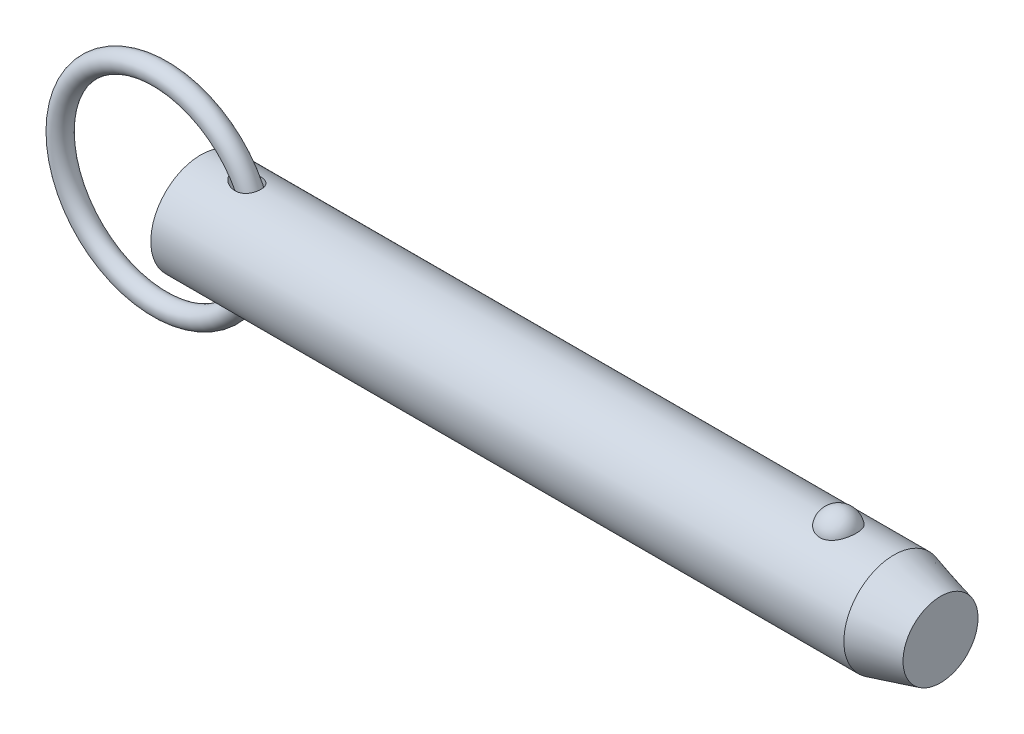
ISO-10303-21;
HEADER;
FILE_DESCRIPTION(('STEP AP214'),'2;1');
FILE_NAME('part.step','',(''),(''),'','','');
FILE_SCHEMA(('AUTOMOTIVE_DESIGN { 1 0 10303 214 1 1 1 1 }'));
ENDSEC;
DATA;
#1=APPLICATION_CONTEXT('core data for automotive mechanical design processes');
#2=APPLICATION_PROTOCOL_DEFINITION('international standard','automotive_design',2000,#1);
#3=PRODUCT_CONTEXT('',#1,'mechanical');
#4=PRODUCT('Part','Part','',(#3));
#5=PRODUCT_RELATED_PRODUCT_CATEGORY('part','',(#4));
#6=PRODUCT_DEFINITION_FORMATION('','',#4);
#7=PRODUCT_DEFINITION_CONTEXT('part definition',#1,'design');
#8=PRODUCT_DEFINITION('design','',#6,#7);
#9=PRODUCT_DEFINITION_SHAPE('','',#8);
#10=(LENGTH_UNIT() NAMED_UNIT(*) SI_UNIT(.MILLI.,.METRE.));
#11=(NAMED_UNIT(*) PLANE_ANGLE_UNIT() SI_UNIT($,.RADIAN.));
#12=(NAMED_UNIT(*) SI_UNIT($,.STERADIAN.) SOLID_ANGLE_UNIT());
#13=UNCERTAINTY_MEASURE_WITH_UNIT(LENGTH_MEASURE(1.E-05),#10,'distance_accuracy_value','');
#14=(GEOMETRIC_REPRESENTATION_CONTEXT(3) GLOBAL_UNCERTAINTY_ASSIGNED_CONTEXT((#13)) GLOBAL_UNIT_ASSIGNED_CONTEXT((#10,
#11,#12)) REPRESENTATION_CONTEXT('',''));
#15=CARTESIAN_POINT('',(0.,0.,0.));
#16=DIRECTION('',(0.,0.,1.));
#17=DIRECTION('',(1.,0.,0.));
#18=AXIS2_PLACEMENT_3D('',#15,#16,#17);
#19=CARTESIAN_POINT('',(-6.46799987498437,0.,0.));
#20=DIRECTION('',(0.,0.,1.));
#21=DIRECTION('',(1.,0.,0.));
#22=AXIS2_PLACEMENT_3D('',#19,#20,#21);
#23=TOROIDAL_SURFACE('',#22,15.875,1.588);
#24=CARTESIAN_POINT('',(10.9950001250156,0.,0.));
#25=VERTEX_POINT('',#24);
#26=VERTEX_LOOP('',#25);
#27=FACE_BOUND('',#26,.T.);
#28=ADVANCED_FACE('P0_F12',(#27),#23,.T.);
#29=CLOSED_SHELL('',(#28));
#30=MANIFOLD_SOLID_BREP('P0_B1',#29);
#31=CARTESIAN_POINT('',(0.,0.,0.));
#32=DIRECTION('',(1.,0.,0.));
#33=DIRECTION('',(0.,0.,-1.));
#34=AXIS2_PLACEMENT_3D('',#31,#32,#33);
#35=CYLINDRICAL_SURFACE('',#34,7.94);
#36=CARTESIAN_POINT('',(5.37881269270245,7.8641200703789,-1.0950869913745));
#37=CARTESIAN_POINT('',(5.49078530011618,7.84653010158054,-1.22142628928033));
#38=CARTESIAN_POINT('',(5.61742164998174,7.82766483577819,-1.33478448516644));
#39=CARTESIAN_POINT('',(5.82155225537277,7.80005811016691,-1.48501770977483));
#40=CARTESIAN_POINT('',(5.89211597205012,7.79095331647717,-1.53186949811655));
#41=CARTESIAN_POINT('',(6.03726296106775,7.77331484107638,-1.61899652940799));
#42=CARTESIAN_POINT('',(6.11184478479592,7.76478095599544,-1.65927412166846));
#43=CARTESIAN_POINT('',(6.31831542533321,7.74290334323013,-1.75933205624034));
#44=CARTESIAN_POINT('',(6.45343253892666,7.73042593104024,-1.81276183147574));
#45=CARTESIAN_POINT('',(6.73017339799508,7.70966096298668,-1.89912673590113));
#46=CARTESIAN_POINT('',(6.8717909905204,7.70136953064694,-1.93208083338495));
#47=CARTESIAN_POINT('',(7.17522096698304,7.6896684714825,-1.97820987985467));
#48=CARTESIAN_POINT('',(7.33750100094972,7.68691980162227,-1.98871513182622));
#49=CARTESIAN_POINT('',(7.5799424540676,7.68880305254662,-1.98137951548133));
#50=CARTESIAN_POINT('',(7.66059155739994,7.69043175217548,-1.97508575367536));
#51=CARTESIAN_POINT('',(7.82077465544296,7.69570110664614,-1.95445819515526));
#52=CARTESIAN_POINT('',(7.9003091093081,7.69934090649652,-1.94012781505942));
#53=CARTESIAN_POINT('',(8.09280087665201,7.71066069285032,-1.89475688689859));
#54=CARTESIAN_POINT('',(8.20465204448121,7.71942251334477,-1.85909462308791));
#55=CARTESIAN_POINT('',(8.42059371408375,7.74035594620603,-1.7699066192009));
#56=CARTESIAN_POINT('',(8.52468939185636,7.75252525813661,-1.7163929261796));
#57=CARTESIAN_POINT('',(8.72211003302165,7.77903750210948,-1.59192358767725));
#58=CARTESIAN_POINT('',(8.81539818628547,7.79338749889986,-1.52091076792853));
#59=CARTESIAN_POINT('',(8.98759177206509,7.8225086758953,-1.36321590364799));
#60=CARTESIAN_POINT('',(9.06649712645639,7.83727985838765,-1.27653377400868));
#61=CARTESIAN_POINT('',(9.20311499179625,7.86453692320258,-1.09567667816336));
#62=CARTESIAN_POINT('',(9.26180839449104,7.8771064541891,-1.00225329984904));
#63=CARTESIAN_POINT('',(9.36257622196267,7.89954213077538,-0.806547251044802));
#64=CARTESIAN_POINT('',(9.40465301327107,7.9094086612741,-0.704265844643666));
#65=CARTESIAN_POINT('',(9.47062404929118,7.92520709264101,-0.49546189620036));
#66=CARTESIAN_POINT('',(9.4947881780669,7.9311972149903,-0.389028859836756));
#67=CARTESIAN_POINT('',(9.52544004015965,7.93883641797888,-0.173494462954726));
#68=CARTESIAN_POINT('',(9.53192786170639,7.94048552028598,-0.0643931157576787));
#69=CARTESIAN_POINT('',(9.52707996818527,7.93926454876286,0.153487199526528));
#70=CARTESIAN_POINT('',(9.51572796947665,7.93639034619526,0.26226578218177));
#71=CARTESIAN_POINT('',(9.47542322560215,7.92642470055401,0.476313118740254));
#72=CARTESIAN_POINT('',(9.44647056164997,7.91933327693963,0.58158188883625));
#73=CARTESIAN_POINT('',(9.37164011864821,7.90170355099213,0.785602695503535));
#74=CARTESIAN_POINT('',(9.32576415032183,7.89116561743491,0.884355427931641));
#75=CARTESIAN_POINT('',(9.21823065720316,7.8677977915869,1.07254831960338));
#76=CARTESIAN_POINT('',(9.15657431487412,7.85496807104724,1.16198917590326));
#77=CARTESIAN_POINT('',(9.01919194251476,7.82843688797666,1.32903649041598));
#78=CARTESIAN_POINT('',(8.94347744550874,7.81473614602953,1.40665255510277));
#79=CARTESIAN_POINT('',(8.78012086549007,7.7879321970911,1.5481977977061));
#80=CARTESIAN_POINT('',(8.69247914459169,7.77482897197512,1.61212739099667));
#81=CARTESIAN_POINT('',(8.50642314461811,7.75037063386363,1.72592270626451));
#82=CARTESIAN_POINT('',(8.40786430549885,7.73904540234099,1.77555777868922));
#83=CARTESIAN_POINT('',(8.2039870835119,7.71943979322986,1.85894844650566));
#84=CARTESIAN_POINT('',(8.0986670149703,7.7111601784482,1.89270006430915));
#85=CARTESIAN_POINT('',(7.87703213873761,7.69782475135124,1.94625652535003));
#86=CARTESIAN_POINT('',(7.76044899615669,7.69301557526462,1.96500324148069));
#87=CARTESIAN_POINT('',(7.52574256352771,7.68770484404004,1.98567257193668));
#88=CARTESIAN_POINT('',(7.40761868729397,7.68720497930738,1.98758858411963));
#89=CARTESIAN_POINT('',(7.15639592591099,7.69044495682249,1.97502233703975));
#90=CARTESIAN_POINT('',(7.02341871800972,7.69476380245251,1.9583009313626));
#91=CARTESIAN_POINT('',(6.76125891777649,7.70776394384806,1.90648094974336));
#92=CARTESIAN_POINT('',(6.6320804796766,7.71644984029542,1.87136299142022));
#93=CARTESIAN_POINT('',(6.35978215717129,7.73875442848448,1.77707737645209));
#94=CARTESIAN_POINT('',(6.2177212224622,7.75293863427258,1.71496895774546));
#95=CARTESIAN_POINT('',(5.94559201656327,7.78383102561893,1.56880760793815));
#96=CARTESIAN_POINT('',(5.81552062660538,7.80053855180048,1.48476040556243));
#97=CARTESIAN_POINT('',(5.60081087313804,7.83035955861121,1.31701356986));
#98=CARTESIAN_POINT('',(5.51265224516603,7.84340226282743,1.23780647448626));
#99=CARTESIAN_POINT('',(5.34976240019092,7.86852524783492,1.06647953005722));
#100=CARTESIAN_POINT('',(5.27500719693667,7.88060722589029,0.974383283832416));
#101=CARTESIAN_POINT('',(5.15877594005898,7.89990441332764,0.800548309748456));
#102=CARTESIAN_POINT('',(5.11360209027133,7.90759876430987,0.721348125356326));
#103=CARTESIAN_POINT('',(5.03655060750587,7.92090267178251,0.55651819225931));
#104=CARTESIAN_POINT('',(5.00466157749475,7.92651401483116,0.470894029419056));
#105=CARTESIAN_POINT('',(4.95653766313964,7.93503671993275,0.294356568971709));
#106=CARTESIAN_POINT('',(4.94043621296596,7.93792505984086,0.203404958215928));
#107=CARTESIAN_POINT('',(4.92605720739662,7.94050250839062,0.0200631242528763));
#108=CARTESIAN_POINT('',(4.92776929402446,7.9401934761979,-0.0723262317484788));
#109=CARTESIAN_POINT('',(4.94742735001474,7.93667454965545,-0.243250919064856));
#110=CARTESIAN_POINT('',(4.96327131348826,7.93384031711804,-0.322048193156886));
#111=CARTESIAN_POINT('',(5.00707570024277,7.92609115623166,-0.476058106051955));
#112=CARTESIAN_POINT('',(5.03503965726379,7.92117562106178,-0.55126969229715));
#113=CARTESIAN_POINT('',(5.10737112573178,7.90866290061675,-0.709995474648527));
#114=CARTESIAN_POINT('',(5.15379379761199,7.90074105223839,-0.792541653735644));
#115=CARTESIAN_POINT('',(5.2582083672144,7.88338732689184,-0.949781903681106));
#116=CARTESIAN_POINT('',(5.31621941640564,7.87395295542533,-1.02446265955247));
#117=CARTESIAN_POINT('',(5.37881269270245,7.8641200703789,-1.0950869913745));
#118=B_SPLINE_CURVE_WITH_KNOTS('',3,(#36,#37,#38,#39,#40,#41,#42,#43,#44,#45,#46,#47,#48,#49,
#50,#51,#52,#53,#54,#55,#56,#57,#58,#59,#60,#61,#62,#63,#64,#65,#66,#67,#68,#69,#70,#71,#72,#73,
#74,#75,#76,#77,#78,#79,#80,#81,#82,#83,#84,#85,#86,#87,#88,#89,#90,#91,#92,#93,#94,#95,#96,#97,
#98,#99,#100,#101,#102,#103,#104,#105,#106,#107,#108,#109,#110,#111,#112,#113,#114,#115,#116,
#117),.UNSPECIFIED.,.T.,.F.,(4,2,2,2,2,2,2,2,2,2,2,2,2,2,2,2,2,2,2,2,2,2,2,2,2,2,2,2,2,2,2,2,2,
2,2,2,2,2,2,2,4),(0.,0.508599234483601,0.763935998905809,1.01918131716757,1.45492798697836,
1.89027038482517,2.37502798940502,2.61739702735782,2.85966310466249,3.21120678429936,
3.56251370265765,3.91498401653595,4.26745624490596,4.59897839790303,4.93045331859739,
5.2568264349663,5.58319792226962,5.909867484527,6.23653553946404,6.56316865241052,
6.88977729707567,7.21611917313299,7.54245114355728,7.87378632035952,8.20520442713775,
8.55832700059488,8.91158808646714,9.31234018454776,9.71351536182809,10.1786231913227,
10.6436096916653,11.0001264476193,11.3559986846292,11.6294791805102,11.9027245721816,
12.1782599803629,12.4536351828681,12.693828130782,12.9340911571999,13.2179277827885,
13.5022374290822),.UNSPECIFIED.);
#119=CARTESIAN_POINT('',(5.37881269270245,7.8641200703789,-1.0950869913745));
#120=VERTEX_POINT('',#119);
#121=EDGE_CURVE('P1_E40',#120,#120,#118,.T.);
#122=ORIENTED_EDGE('',*,*,#121,.T.);
#123=EDGE_LOOP('',(#122));
#124=FACE_BOUND('',#123,.T.);
#125=CARTESIAN_POINT('',(110.071879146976,0.,0.));
#126=DIRECTION('',(1.,0.,0.));
#127=DIRECTION('',(0.,0.,-1.));
#128=AXIS2_PLACEMENT_3D('',#125,#126,#127);
#129=CIRCLE('',#128,7.94);
#130=CARTESIAN_POINT('',(110.071879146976,0.,-7.94));
#131=VERTEX_POINT('',#130);
#132=EDGE_CURVE('P1_E25',#131,#131,#129,.T.);
#133=ORIENTED_EDGE('',*,*,#132,.F.);
#134=EDGE_LOOP('',(#133));
#135=FACE_BOUND('',#134,.T.);
#136=CARTESIAN_POINT('',(0.,0.,0.));
#137=DIRECTION('',(1.,0.,0.));
#138=DIRECTION('',(0.,0.,-1.));
#139=AXIS2_PLACEMENT_3D('',#136,#137,#138);
#140=CIRCLE('',#139,7.94);
#141=CARTESIAN_POINT('',(0.,0.,-7.94));
#142=VERTEX_POINT('',#141);
#143=EDGE_CURVE('P1_E9',#142,#142,#140,.T.);
#144=ORIENTED_EDGE('',*,*,#143,.T.);
#145=EDGE_LOOP('',(#144));
#146=FACE_BOUND('',#145,.T.);
#147=CARTESIAN_POINT('',(101.264907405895,7.37767842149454,2.93486986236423));
#148=CARTESIAN_POINT('',(101.112749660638,7.3776732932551,2.93487505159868));
#149=CARTESIAN_POINT('',(100.960632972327,7.38258419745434,2.92262454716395));
#150=CARTESIAN_POINT('',(100.660928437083,7.40163229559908,2.87404196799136));
#151=CARTESIAN_POINT('',(100.513339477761,7.41576720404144,2.83771585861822));
#152=CARTESIAN_POINT('',(100.227018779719,7.4516157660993,2.74218769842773));
#153=CARTESIAN_POINT('',(100.088274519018,7.47331841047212,2.68301886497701));
#154=CARTESIAN_POINT('',(99.8228822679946,7.52194082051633,2.54350967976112));
#155=CARTESIAN_POINT('',(99.6962366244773,7.5488615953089,2.46316523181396));
#156=CARTESIAN_POINT('',(99.4545349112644,7.60594671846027,2.28090375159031));
#157=CARTESIAN_POINT('',(99.3399065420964,7.63618114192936,2.17844211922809));
#158=CARTESIAN_POINT('',(99.1288787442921,7.69614046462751,1.95608495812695));
#159=CARTESIAN_POINT('',(99.0324826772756,7.72586526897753,1.83618622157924));
#160=CARTESIAN_POINT('',(98.8559381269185,7.78314821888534,1.57628086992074));
#161=CARTESIAN_POINT('',(98.7767072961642,7.81055035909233,1.43561546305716));
#162=CARTESIAN_POINT('',(98.6417979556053,7.85879631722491,1.14236334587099));
#163=CARTESIAN_POINT('',(98.5861216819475,7.87963951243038,0.989775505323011));
#164=CARTESIAN_POINT('',(98.4988121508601,7.91289645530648,0.674619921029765));
#165=CARTESIAN_POINT('',(98.4675309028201,7.925186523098,0.511941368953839));
#166=CARTESIAN_POINT('',(98.430975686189,7.93958930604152,0.183247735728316));
#167=CARTESIAN_POINT('',(98.4257012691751,7.94170219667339,0.0172327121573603));
#168=CARTESIAN_POINT('',(98.4412311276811,7.93554931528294,-0.312672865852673));
#169=CARTESIAN_POINT('',(98.4619253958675,7.92732732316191,-0.476569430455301));
#170=CARTESIAN_POINT('',(98.5287865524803,7.90141534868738,-0.798305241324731));
#171=CARTESIAN_POINT('',(98.5749539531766,7.88372517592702,-0.956144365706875));
#172=CARTESIAN_POINT('',(98.6918986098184,7.84066230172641,-1.26152073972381));
#173=CARTESIAN_POINT('',(98.7627046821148,7.81528060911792,-1.40904568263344));
#174=CARTESIAN_POINT('',(98.9274789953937,7.7594867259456,-1.68950598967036));
#175=CARTESIAN_POINT('',(99.0214488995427,7.72907417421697,-1.82244030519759));
#176=CARTESIAN_POINT('',(99.2308391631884,7.66640424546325,-2.07032792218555));
#177=CARTESIAN_POINT('',(99.3463152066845,7.63414223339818,-2.1852330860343));
#178=CARTESIAN_POINT('',(99.5959006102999,7.57149681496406,-2.39329737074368));
#179=CARTESIAN_POINT('',(99.7300080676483,7.54111321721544,-2.48645870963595));
#180=CARTESIAN_POINT('',(100.010111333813,7.48650742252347,-2.64628132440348));
#181=CARTESIAN_POINT('',(100.155760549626,7.46215900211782,-2.71350554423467));
#182=CARTESIAN_POINT('',(100.457425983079,7.42171253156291,-2.82226614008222));
#183=CARTESIAN_POINT('',(100.613438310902,7.40561140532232,-2.86381209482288));
#184=CARTESIAN_POINT('',(100.922970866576,7.3842679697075,-2.9183907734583));
#185=CARTESIAN_POINT('',(101.076222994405,7.37852109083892,-2.93275024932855));
#186=CARTESIAN_POINT('',(101.383070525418,7.37700973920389,-2.93655208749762));
#187=CARTESIAN_POINT('',(101.536665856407,7.38124333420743,-2.92599927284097));
#188=CARTESIAN_POINT('',(101.834990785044,7.39890635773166,-2.88102897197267));
#189=CARTESIAN_POINT('',(101.979848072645,7.41205491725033,-2.8473399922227));
#190=CARTESIAN_POINT('',(102.26164329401,7.445801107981,-2.75788206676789));
#191=CARTESIAN_POINT('',(102.398580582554,7.46639934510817,-2.70211132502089));
#192=CARTESIAN_POINT('',(102.664061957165,7.51339098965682,-2.56858908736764));
#193=CARTESIAN_POINT('',(102.792354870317,7.53990200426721,-2.49038067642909));
#194=CARTESIAN_POINT('',(103.034244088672,7.59569503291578,-2.31462737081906));
#195=CARTESIAN_POINT('',(103.147837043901,7.62497767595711,-2.21707808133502));
#196=CARTESIAN_POINT('',(103.36322156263,7.68489473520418,-1.99982049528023));
#197=CARTESIAN_POINT('',(103.464148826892,7.71552419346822,-1.87925337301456));
#198=CARTESIAN_POINT('',(103.645186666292,7.77353016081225,-1.62268826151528));
#199=CARTESIAN_POINT('',(103.725293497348,7.80090608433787,-1.4866875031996));
#200=CARTESIAN_POINT('',(103.865361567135,7.85047992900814,-1.19818413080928));
#201=CARTESIAN_POINT('',(103.924587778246,7.8724818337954,-1.04529016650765));
#202=CARTESIAN_POINT('',(104.017982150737,7.90785114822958,-0.731080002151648));
#203=CARTESIAN_POINT('',(104.052149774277,7.92121837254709,-0.569763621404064));
#204=CARTESIAN_POINT('',(104.094795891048,7.93797834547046,-0.242812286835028));
#205=CARTESIAN_POINT('',(104.103204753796,7.94134405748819,-0.0771668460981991));
#206=CARTESIAN_POINT('',(104.093962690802,7.93767937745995,0.253276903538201));
#207=CARTESIAN_POINT('',(104.076312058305,7.93064910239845,0.41807522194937));
#208=CARTESIAN_POINT('',(104.015424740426,7.90695571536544,0.741525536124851));
#209=CARTESIAN_POINT('',(103.972281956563,7.8903279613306,0.900197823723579));
#210=CARTESIAN_POINT('',(103.86135358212,7.84916386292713,1.20759654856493));
#211=CARTESIAN_POINT('',(103.79356656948,7.82462706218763,1.35632241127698));
#212=CARTESIAN_POINT('',(103.634371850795,7.7700669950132,1.64032869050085));
#213=CARTESIAN_POINT('',(103.542861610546,7.7400200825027,1.77554712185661));
#214=CARTESIAN_POINT('',(103.338296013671,7.67774175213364,2.02800648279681));
#215=CARTESIAN_POINT('',(103.225241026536,7.64551037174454,2.14524772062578));
#216=CARTESIAN_POINT('',(102.980831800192,7.58265895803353,2.35778002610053));
#217=CARTESIAN_POINT('',(102.849583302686,7.5520309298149,2.45319004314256));
#218=CARTESIAN_POINT('',(102.571601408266,7.49579792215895,2.61999897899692));
#219=CARTESIAN_POINT('',(102.424867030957,7.47019326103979,2.69139637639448));
#220=CARTESIAN_POINT('',(102.112947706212,7.42622216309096,2.8105324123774));
#221=CARTESIAN_POINT('',(101.947220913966,7.40825002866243,2.85700910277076));
#222=CARTESIAN_POINT('',(101.609279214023,7.38398348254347,2.9191685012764));
#223=CARTESIAN_POINT('',(101.43706702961,7.3776842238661,2.93486399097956));
#224=CARTESIAN_POINT('',(101.264907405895,7.37767842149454,2.93486986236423));
#225=B_SPLINE_CURVE_WITH_KNOTS('',3,(#147,#148,#149,#150,#151,#152,#153,#154,#155,#156,#157,
#158,#159,#160,#161,#162,#163,#164,#165,#166,#167,#168,#169,#170,#171,#172,#173,#174,#175,#176,
#177,#178,#179,#180,#181,#182,#183,#184,#185,#186,#187,#188,#189,#190,#191,#192,#193,#194,#195,
#196,#197,#198,#199,#200,#201,#202,#203,#204,#205,#206,#207,#208,#209,#210,#211,#212,#213,#214,
#215,#216,#217,#218,#219,#220,#221,#222,#223,#224),.UNSPECIFIED.,.T.,.F.,(4,2,2,2,2,2,2,2,2,2,2,
2,2,2,2,2,2,2,2,2,2,2,2,2,2,2,2,2,2,2,2,2,2,2,2,2,2,2,4),(0.,0.45584132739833,0.911569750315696,
1.36663794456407,1.8217942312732,2.28978983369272,2.7578716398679,3.246853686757,
3.73588214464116,4.23184282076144,4.7277949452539,5.22165321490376,5.71552141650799,
6.20996917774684,6.70445245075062,7.20023431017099,7.69596557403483,8.18023418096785,
8.66432203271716,9.12410697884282,9.58380291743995,10.0296503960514,10.4755341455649,
10.9312349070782,11.3870393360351,11.8654416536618,12.3439299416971,12.8378875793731,
13.3318558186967,13.8271581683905,14.3224549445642,14.8159385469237,15.3094506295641,
15.8051323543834,16.3008055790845,16.7937101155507,17.2866458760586,17.8026240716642,
18.3183879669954),.UNSPECIFIED.);
#226=CARTESIAN_POINT('',(101.264907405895,7.37767842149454,2.93486986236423));
#227=VERTEX_POINT('',#226);
#228=EDGE_CURVE('P1_E34',#227,#227,#225,.T.);
#229=ORIENTED_EDGE('',*,*,#228,.T.);
#230=EDGE_LOOP('',(#229));
#231=FACE_BOUND('',#230,.T.);
#232=CARTESIAN_POINT('',(5.37881269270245,-7.8641200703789,-1.0950869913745));
#233=CARTESIAN_POINT('',(5.31532711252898,-7.87409326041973,-1.02345575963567));
#234=CARTESIAN_POINT('',(5.25654962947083,-7.88365715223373,-0.947641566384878));
#235=CARTESIAN_POINT('',(5.15093536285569,-7.90122221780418,-0.787865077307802));
#236=CARTESIAN_POINT('',(5.10408931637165,-7.90922460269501,-0.703909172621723));
#237=CARTESIAN_POINT('',(5.02499142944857,-7.92292057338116,-0.527991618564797));
#238=CARTESIAN_POINT('',(4.99290048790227,-7.92858863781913,-0.435954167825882));
#239=CARTESIAN_POINT('',(4.94718343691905,-7.93670712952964,-0.247266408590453));
#240=CARTESIAN_POINT('',(4.93353142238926,-7.93916207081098,-0.150622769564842));
#241=CARTESIAN_POINT('',(4.92669426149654,-7.94038957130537,0.03064599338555));
#242=CARTESIAN_POINT('',(4.9310562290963,-7.93960347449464,0.115182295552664));
#243=CARTESIAN_POINT('',(4.95441758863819,-7.93542535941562,0.282133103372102));
#244=CARTESIAN_POINT('',(4.97342060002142,-7.93203269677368,0.364547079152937));
#245=CARTESIAN_POINT('',(5.02337664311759,-7.92322764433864,0.521528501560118));
#246=CARTESIAN_POINT('',(5.05377582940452,-7.91790920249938,0.596281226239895));
#247=CARTESIAN_POINT('',(5.1246872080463,-7.90571364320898,0.740640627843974));
#248=CARTESIAN_POINT('',(5.16520358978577,-7.89883588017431,0.810245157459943));
#249=CARTESIAN_POINT('',(5.27792634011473,-7.88012470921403,0.978620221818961));
#250=CARTESIAN_POINT('',(5.35563200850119,-7.86757912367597,1.07363778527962));
#251=CARTESIAN_POINT('',(5.52523836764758,-7.84150676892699,1.24994147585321));
#252=CARTESIAN_POINT('',(5.61717506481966,-7.82797755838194,1.33119164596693));
#253=CARTESIAN_POINT('',(5.83913717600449,-7.79742756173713,1.50104748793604));
#254=CARTESIAN_POINT('',(5.9725742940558,-7.78050347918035,1.58521567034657));
#255=CARTESIAN_POINT('',(6.25160600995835,-7.74942135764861,1.73078109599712));
#256=CARTESIAN_POINT('',(6.39720857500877,-7.73526515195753,1.79216327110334));
#257=CARTESIAN_POINT('',(6.69793322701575,-7.7116170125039,1.89134478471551));
#258=CARTESIAN_POINT('',(6.85312134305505,-7.70216275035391,1.92895428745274));
#259=CARTESIAN_POINT('',(7.16781951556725,-7.68988337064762,1.97736316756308));
#260=CARTESIAN_POINT('',(7.32732244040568,-7.68704791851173,1.98820434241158));
#261=CARTESIAN_POINT('',(7.61290770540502,-7.68890797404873,1.98097687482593));
#262=CARTESIAN_POINT('',(7.73913797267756,-7.69217875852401,1.96837928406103));
#263=CARTESIAN_POINT('',(7.98774248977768,-7.70364253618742,1.92303262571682));
#264=CARTESIAN_POINT('',(8.11011880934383,-7.71183283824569,1.89029457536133));
#265=CARTESIAN_POINT('',(8.34766306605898,-7.73253074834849,1.80375920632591));
#266=CARTESIAN_POINT('',(8.46278682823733,-7.74506226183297,1.74984505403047));
#267=CARTESIAN_POINT('',(8.6806268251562,-7.77294147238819,1.62149891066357));
#268=CARTESIAN_POINT('',(8.78334736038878,-7.78828818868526,1.54707406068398));
#269=CARTESIAN_POINT('',(8.96275951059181,-7.81808719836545,1.38814746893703));
#270=CARTESIAN_POINT('',(9.0410292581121,-7.83247448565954,1.30540890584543));
#271=CARTESIAN_POINT('',(9.18176824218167,-7.86008608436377,1.1272733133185));
#272=CARTESIAN_POINT('',(9.24424163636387,-7.87331070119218,1.03187962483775));
#273=CARTESIAN_POINT('',(9.34924815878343,-7.89649032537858,0.835684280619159));
#274=CARTESIAN_POINT('',(9.39252490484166,-7.90656172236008,0.73529314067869));
#275=CARTESIAN_POINT('',(9.46188913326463,-7.92307290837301,0.528458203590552));
#276=CARTESIAN_POINT('',(9.48797767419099,-7.92951292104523,0.422014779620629));
#277=CARTESIAN_POINT('',(9.5222867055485,-7.93804067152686,0.206589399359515));
#278=CARTESIAN_POINT('',(9.53058328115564,-7.94014694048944,0.0976202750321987));
#279=CARTESIAN_POINT('',(9.52935292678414,-7.93983698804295,-0.120212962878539));
#280=CARTESIAN_POINT('',(9.51982577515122,-7.9374207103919,-0.229077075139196));
#281=CARTESIAN_POINT('',(9.48313466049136,-7.92831916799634,-0.443751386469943));
#282=CARTESIAN_POINT('',(9.45594838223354,-7.92162850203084,-0.549557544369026));
#283=CARTESIAN_POINT('',(9.3845465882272,-7.90469917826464,-0.754954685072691));
#284=CARTESIAN_POINT('',(9.34033171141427,-7.89446065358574,-0.854545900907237));
#285=CARTESIAN_POINT('',(9.23602927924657,-7.87157146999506,-1.04456732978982));
#286=CARTESIAN_POINT('',(9.17596171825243,-7.85892385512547,-1.13500888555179));
#287=CARTESIAN_POINT('',(9.04153430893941,-7.83259746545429,-1.30436780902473));
#288=CARTESIAN_POINT('',(8.96717562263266,-7.81891877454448,-1.38328611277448));
#289=CARTESIAN_POINT('',(8.80603455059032,-7.79196869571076,-1.52782923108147));
#290=CARTESIAN_POINT('',(8.71921490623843,-7.77869867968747,-1.59341269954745));
#291=CARTESIAN_POINT('',(8.53589430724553,-7.7539823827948,-1.7096493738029));
#292=CARTESIAN_POINT('',(8.43939269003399,-7.74253622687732,-1.76030155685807));
#293=CARTESIAN_POINT('',(8.23614706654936,-7.72219212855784,-1.84754820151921));
#294=CARTESIAN_POINT('',(8.12916866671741,-7.71339202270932,-1.88361685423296));
#295=CARTESIAN_POINT('',(7.91082287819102,-7.69955300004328,-1.93940887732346));
#296=CARTESIAN_POINT('',(7.79945379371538,-7.69451555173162,-1.95912586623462));
#297=CARTESIAN_POINT('',(7.56409927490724,-7.6881073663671,-1.98413612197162));
#298=CARTESIAN_POINT('',(7.43993744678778,-7.68713944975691,-1.98784574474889));
#299=CARTESIAN_POINT('',(7.19239878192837,-7.68969629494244,-1.97792309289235));
#300=CARTESIAN_POINT('',(7.0690222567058,-7.69322274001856,-1.96428432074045));
#301=CARTESIAN_POINT('',(6.80624991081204,-7.70498367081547,-1.91768089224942));
#302=CARTESIAN_POINT('',(6.667361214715,-7.71386737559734,-1.88203087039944));
#303=CARTESIAN_POINT('',(6.39625444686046,-7.73551250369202,-1.79098714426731));
#304=CARTESIAN_POINT('',(6.26404857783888,-7.74828074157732,-1.73555871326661));
#305=CARTESIAN_POINT('',(6.06559048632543,-7.77003865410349,-1.63446133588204));
#306=CARTESIAN_POINT('',(5.99591479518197,-7.77821880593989,-1.59522999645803));
#307=CARTESIAN_POINT('',(5.86025875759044,-7.79503524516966,-1.51091846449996));
#308=CARTESIAN_POINT('',(5.79427944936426,-7.80367165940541,-1.46583664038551));
#309=CARTESIAN_POINT('',(5.60322733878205,-7.82978128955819,-1.3219827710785));
#310=CARTESIAN_POINT('',(5.48449649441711,-7.84751780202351,-1.21433077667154));
#311=CARTESIAN_POINT('',(5.37881269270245,-7.8641200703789,-1.0950869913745));
#312=B_SPLINE_CURVE_WITH_KNOTS('',3,(#232,#233,#234,#235,#236,#237,#238,#239,#240,#241,#242,
#243,#244,#245,#246,#247,#248,#249,#250,#251,#252,#253,#254,#255,#256,#257,#258,#259,#260,#261,
#262,#263,#264,#265,#266,#267,#268,#269,#270,#271,#272,#273,#274,#275,#276,#277,#278,#279,#280,
#281,#282,#283,#284,#285,#286,#287,#288,#289,#290,#291,#292,#293,#294,#295,#296,#297,#298,#299,
#300,#301,#302,#303,#304,#305,#306,#307,#308,#309,#310,#311),.UNSPECIFIED.,.T.,.F.,(4,2,2,2,2,2,
2,2,2,2,2,2,2,2,2,2,2,2,2,2,2,2,2,2,2,2,2,2,2,2,2,2,2,2,2,2,2,2,2,4),(0.,0.288363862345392,
0.576503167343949,0.867714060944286,1.15851540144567,1.41111828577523,1.66378363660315,
1.90549406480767,2.1473047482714,2.51540453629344,2.88445136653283,3.35805159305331,
3.83196445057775,4.30961543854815,4.78652012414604,5.16565662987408,5.54458592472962,
5.92563591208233,6.30655339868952,6.64920782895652,6.99177197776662,7.31956587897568,
7.64733959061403,7.97370879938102,8.30008206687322,8.62686856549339,8.95364280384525,
9.28000684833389,9.60634436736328,9.93367879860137,10.261035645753,10.59932199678,
10.9377403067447,11.308967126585,11.6803330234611,12.1096921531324,12.5398088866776,
12.7806650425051,13.0215885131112,13.5016249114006),.UNSPECIFIED.);
#313=CARTESIAN_POINT('',(5.37881269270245,-7.8641200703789,-1.0950869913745));
#314=VERTEX_POINT('',#313);
#315=EDGE_CURVE('P1_E17',#314,#314,#312,.T.);
#316=ORIENTED_EDGE('',*,*,#315,.T.);
#317=EDGE_LOOP('',(#316));
#318=FACE_BOUND('',#317,.T.);
#319=ADVANCED_FACE('P1_F13',(#124,#135,#146,#231,#318),#35,.T.);
#320=CARTESIAN_POINT('',(0.,0.,0.));
#321=DIRECTION('',(-1.,0.,0.));
#322=DIRECTION('',(0.,0.,1.));
#323=AXIS2_PLACEMENT_3D('',#320,#321,#322);
#324=PLANE('',#323);
#325=ORIENTED_EDGE('',*,*,#143,.F.);
#326=EDGE_LOOP('',(#325));
#327=FACE_BOUND('',#326,.T.);
#328=ADVANCED_FACE('P1_F15',(#327),#324,.T.);
#329=CARTESIAN_POINT('',(117.48,0.,0.));
#330=DIRECTION('',(-1.,0.,0.));
#331=DIRECTION('',(0.,0.,1.));
#332=AXIS2_PLACEMENT_3D('',#329,#330,#331);
#333=CONICAL_SURFACE('',#332,5.95500000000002,0.26179938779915);
#334=ORIENTED_EDGE('',*,*,#132,.T.);
#335=EDGE_LOOP('',(#334));
#336=FACE_BOUND('',#335,.T.);
#337=CARTESIAN_POINT('',(117.48,0.,0.));
#338=DIRECTION('',(1.,0.,0.));
#339=DIRECTION('',(0.,0.,-1.));
#340=AXIS2_PLACEMENT_3D('',#337,#338,#339);
#341=CIRCLE('',#340,5.95500000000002);
#342=CARTESIAN_POINT('',(117.48,0.,-5.95500000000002));
#343=VERTEX_POINT('',#342);
#344=EDGE_CURVE('P1_E30',#343,#343,#341,.T.);
#345=ORIENTED_EDGE('',*,*,#344,.F.);
#346=EDGE_LOOP('',(#345));
#347=FACE_BOUND('',#346,.T.);
#348=ADVANCED_FACE('P1_F55',(#336,#347),#333,.T.);
#349=CARTESIAN_POINT('',(117.48,5.95500000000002,0.));
#350=DIRECTION('',(1.,0.,0.));
#351=DIRECTION('',(0.,0.,-1.));
#352=AXIS2_PLACEMENT_3D('',#349,#350,#351);
#353=PLANE('',#352);
#354=ORIENTED_EDGE('',*,*,#344,.T.);
#355=EDGE_LOOP('',(#354));
#356=FACE_BOUND('',#355,.T.);
#357=ADVANCED_FACE('P1_F51',(#356),#353,.T.);
#358=CARTESIAN_POINT('',(101.264907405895,7.146,0.));
#359=DIRECTION('',(-1.,0.,0.));
#360=DIRECTION('',(0.,-1.,0.));
#361=AXIS2_PLACEMENT_3D('',#358,#359,#360);
#362=SPHERICAL_SURFACE('',#361,2.944);
#363=ORIENTED_EDGE('',*,*,#228,.F.);
#364=EDGE_LOOP('',(#363));
#365=FACE_BOUND('',#364,.T.);
#366=ADVANCED_FACE('P1_F46',(#365),#362,.T.);
#367=CARTESIAN_POINT('',(-6.46799987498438,0.,0.));
#368=DIRECTION('',(0.,0.,1.));
#369=DIRECTION('',(1.,0.,0.));
#370=AXIS2_PLACEMENT_3D('',#367,#368,#369);
#371=TOROIDAL_SURFACE('',#370,15.875,1.985);
#372=ORIENTED_EDGE('',*,*,#315,.F.);
#373=EDGE_LOOP('',(#372));
#374=FACE_BOUND('',#373,.T.);
#375=ORIENTED_EDGE('',*,*,#121,.F.);
#376=EDGE_LOOP('',(#375));
#377=FACE_BOUND('',#376,.T.);
#378=ADVANCED_FACE('P1_F50',(#374,#377),#371,.F.);
#379=CLOSED_SHELL('',(#319,#328,#348,#357,#366,#378));
#380=MANIFOLD_SOLID_BREP('P1_B1',#379);
#381=ADVANCED_BREP_SHAPE_REPRESENTATION('',(#18,#30,#380),#14);
#382=SHAPE_DEFINITION_REPRESENTATION(#9,#381);
ENDSEC;
END-ISO-10303-21;
